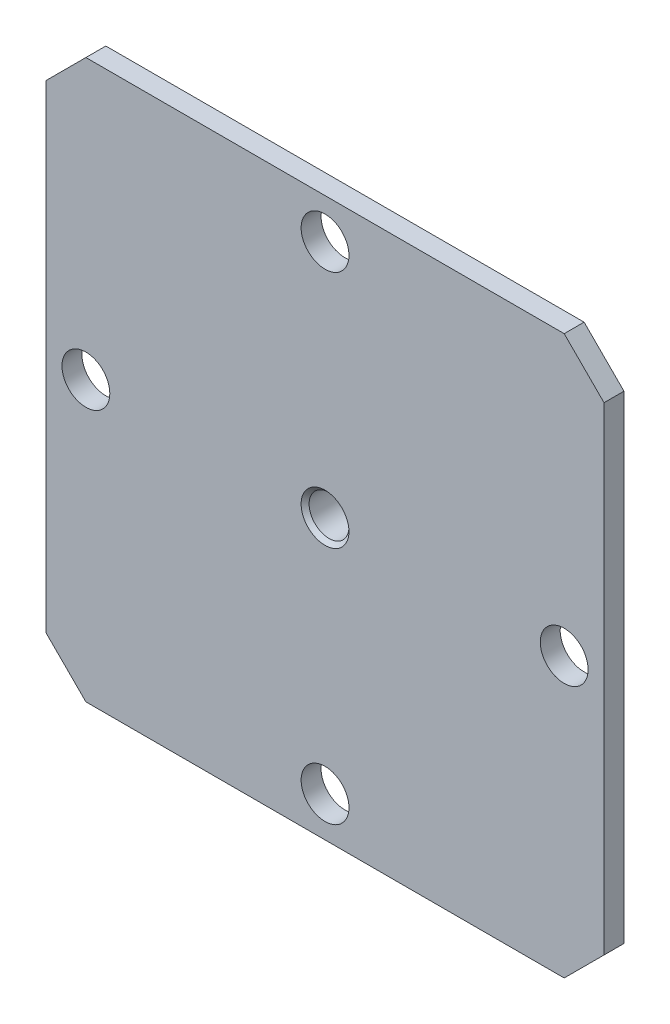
from build123d import *

# Parameters (mm, degrees)
SKETCH1_W          = 140
SKETCH1_H          = 140
EXTRUDE1_DEPTH     = 5
CUT_EXTRUDE1_REACH = 101.121
SKETCH2_R          = 6
CHAMFER1_SIZE      = 10
EXTRUDE2_START     = -5
SKETCH3_W          = 20
SKETCH3_H          = 20
EXTRUDE2_DEPTH     = 7
CUT_EXTRUDE2_REACH = 101.72
SKETCH4_R          = 5
CHAMFER2_SIZE      = 1


with BuildPart() as part:
    # Sketch1 → Extrude1 (new body)
    with BuildSketch(Plane.XY):
        Rectangle(SKETCH1_W, SKETCH1_H)
    extrude(amount=EXTRUDE1_DEPTH)

    # Sketch2 → Cut-Extrude1 (cut, up to next)
    with BuildSketch(Plane.XY.offset(5), mode=Mode.PRIVATE) as cut_extrude1_sk1:
        with Locations((0, 60)):
            Circle(SKETCH2_R)
    cut_extrude1_tool1 = extrude(cut_extrude1_sk1.sketch, amount=-CUT_EXTRUDE1_REACH, mode=Mode.PRIVATE) & part.part
    # Sketch2 → Cut-Extrude1 (cut, up to next)
    with BuildSketch(Plane.XY.offset(5), mode=Mode.PRIVATE) as cut_extrude1_sk2:
        with Locations((60, 0)):
            Circle(SKETCH2_R)
    cut_extrude1_tool2 = extrude(cut_extrude1_sk2.sketch, amount=-CUT_EXTRUDE1_REACH, mode=Mode.PRIVATE) & part.part
    # Sketch2 → Cut-Extrude1 (cut, up to next)
    with BuildSketch(Plane.XY.offset(5), mode=Mode.PRIVATE) as cut_extrude1_sk3:
        with Locations((0, -60)):
            Circle(SKETCH2_R)
    cut_extrude1_tool3 = extrude(cut_extrude1_sk3.sketch, amount=-CUT_EXTRUDE1_REACH, mode=Mode.PRIVATE) & part.part
    # Sketch2 → Cut-Extrude1 (cut, up to next)
    with BuildSketch(Plane.XY.offset(5), mode=Mode.PRIVATE) as cut_extrude1_sk4:
        with Locations((-60, 0)):
            Circle(SKETCH2_R)
    cut_extrude1_tool4 = extrude(cut_extrude1_sk4.sketch, amount=-CUT_EXTRUDE1_REACH, mode=Mode.PRIVATE) & part.part
    add(cut_extrude1_tool1.solids().sort_by_distance((0, 60, 5))[0], mode=Mode.SUBTRACT)
    add(cut_extrude1_tool2.solids().sort_by_distance((60, 0, 5))[0], mode=Mode.SUBTRACT)
    add(cut_extrude1_tool3.solids().sort_by_distance((0, -60, 5))[0], mode=Mode.SUBTRACT)
    add(cut_extrude1_tool4.solids().sort_by_distance((-60, 0, 5))[0], mode=Mode.SUBTRACT)

    # Chamfer1
    chamfer1_edges = [part.edges().sort_by_distance(p)[0] for p in [
        (70, 70, 2.5),
        (70, -70, 2.5),
        (-70, -70, 2.5),
        (-70, 70, 2.5),
    ]]
    chamfer(chamfer1_edges, length=CHAMFER1_SIZE)

    # Sketch3 → Extrude2 (add)
    with BuildSketch(Plane.XY.offset(5).offset(EXTRUDE2_START)):
        Rectangle(SKETCH3_W, SKETCH3_H)
    extrude(amount=-EXTRUDE2_DEPTH)

    # Sketch4 → Cut-Extrude2 (cut, up to next)
    with BuildSketch(Plane.XY.offset(5), mode=Mode.PRIVATE) as cut_extrude2_sk1:
        Circle(SKETCH4_R)
    cut_extrude2_tool1 = extrude(cut_extrude2_sk1.sketch, amount=-CUT_EXTRUDE2_REACH, mode=Mode.PRIVATE) & part.part
    add(cut_extrude2_tool1.solids().sort_by_distance((0, 0, 5))[0], mode=Mode.SUBTRACT)

    # Chamfer2
    chamfer2_edges = [part.edges().sort_by_distance(p)[0] for p in [
        (-5, 0, 5),
    ]]
    chamfer(chamfer2_edges, length=CHAMFER2_SIZE)


solid = part.part
